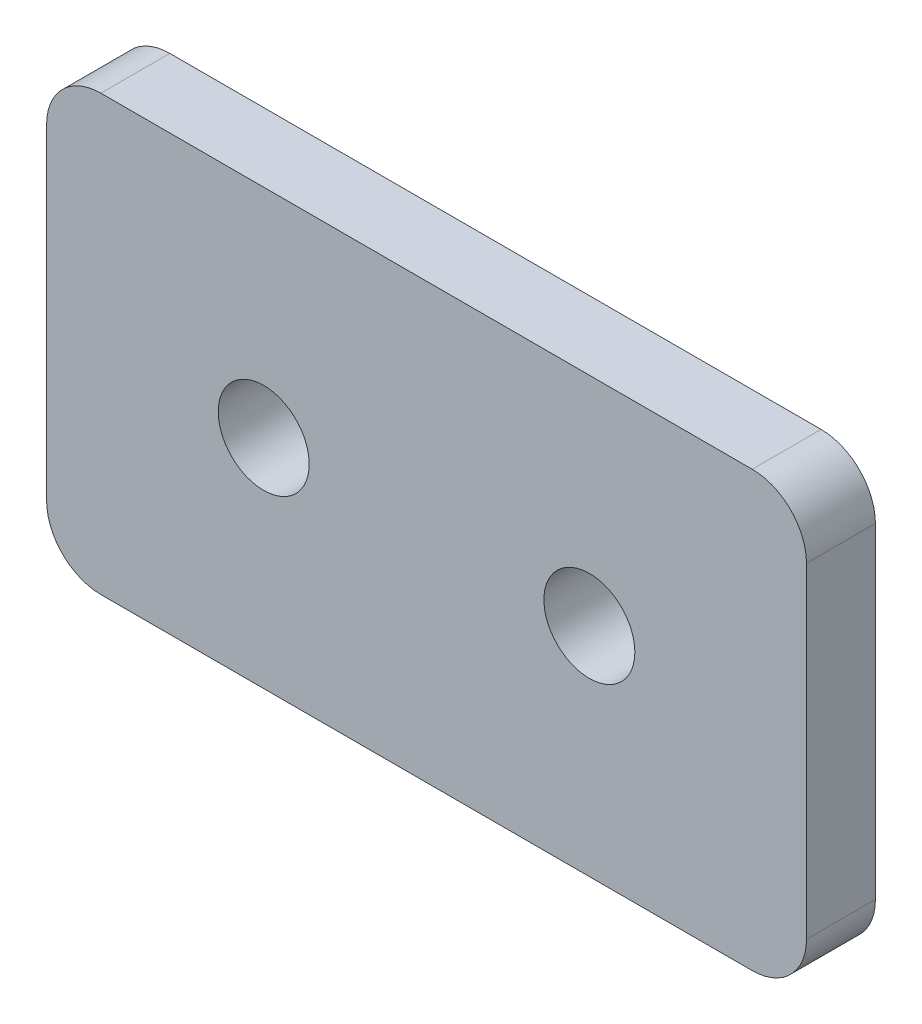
ISO-10303-21;
HEADER;
FILE_DESCRIPTION(('STEP AP214'),'2;1');
FILE_NAME('part.step','',(''),(''),'','','');
FILE_SCHEMA(('AUTOMOTIVE_DESIGN { 1 0 10303 214 1 1 1 1 }'));
ENDSEC;
DATA;
#1=APPLICATION_CONTEXT('core data for automotive mechanical design processes');
#2=APPLICATION_PROTOCOL_DEFINITION('international standard','automotive_design',2000,#1);
#3=PRODUCT_CONTEXT('',#1,'mechanical');
#4=PRODUCT('Part','Part','',(#3));
#5=PRODUCT_RELATED_PRODUCT_CATEGORY('part','',(#4));
#6=PRODUCT_DEFINITION_FORMATION('','',#4);
#7=PRODUCT_DEFINITION_CONTEXT('part definition',#1,'design');
#8=PRODUCT_DEFINITION('design','',#6,#7);
#9=PRODUCT_DEFINITION_SHAPE('','',#8);
#10=(LENGTH_UNIT() NAMED_UNIT(*) SI_UNIT(.MILLI.,.METRE.));
#11=(NAMED_UNIT(*) PLANE_ANGLE_UNIT() SI_UNIT($,.RADIAN.));
#12=(NAMED_UNIT(*) SI_UNIT($,.STERADIAN.) SOLID_ANGLE_UNIT());
#13=UNCERTAINTY_MEASURE_WITH_UNIT(LENGTH_MEASURE(1.E-05),#10,'distance_accuracy_value','');
#14=(GEOMETRIC_REPRESENTATION_CONTEXT(3) GLOBAL_UNCERTAINTY_ASSIGNED_CONTEXT((#13)) GLOBAL_UNIT_ASSIGNED_CONTEXT((#10,
#11,#12)) REPRESENTATION_CONTEXT('',''));
#15=CARTESIAN_POINT('',(0.,0.,0.));
#16=DIRECTION('',(0.,0.,1.));
#17=DIRECTION('',(1.,0.,0.));
#18=AXIS2_PLACEMENT_3D('',#15,#16,#17);
#19=CARTESIAN_POINT('',(25.0000000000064,0.,3.175));
#20=DIRECTION('',(1.,0.,0.));
#21=DIRECTION('',(0.,0.,-1.));
#22=AXIS2_PLACEMENT_3D('',#19,#20,#21);
#23=PLANE('',#22);
#24=DIRECTION('',(0.,-1.,0.));
#25=VECTOR('',#24,1.);
#26=CARTESIAN_POINT('',(25.0000000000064,0.,3.175));
#27=LINE('',#26,#25);
#28=CARTESIAN_POINT('',(25.0000000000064,7.50000000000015,3.175));
#29=VERTEX_POINT('',#28);
#30=CARTESIAN_POINT('',(25.0000000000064,-7.50000000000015,3.175));
#31=VERTEX_POINT('',#30);
#32=EDGE_CURVE('E165',#29,#31,#27,.T.);
#33=ORIENTED_EDGE('',*,*,#32,.T.);
#34=DIRECTION('',(0.,0.,-1.));
#35=VECTOR('',#34,1.);
#36=CARTESIAN_POINT('',(25.0000000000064,-7.50000000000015,0.));
#37=LINE('',#36,#35);
#38=CARTESIAN_POINT('',(25.0000000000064,-7.50000000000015,0.));
#39=VERTEX_POINT('',#38);
#40=EDGE_CURVE('E126',#31,#39,#37,.T.);
#41=ORIENTED_EDGE('',*,*,#40,.T.);
#42=DIRECTION('',(0.,-1.,0.));
#43=VECTOR('',#42,1.);
#44=CARTESIAN_POINT('',(25.0000000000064,0.,0.));
#45=LINE('',#44,#43);
#46=CARTESIAN_POINT('',(25.0000000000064,7.50000000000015,0.));
#47=VERTEX_POINT('',#46);
#48=EDGE_CURVE('E110',#47,#39,#45,.T.);
#49=ORIENTED_EDGE('',*,*,#48,.F.);
#50=DIRECTION('',(0.,0.,-1.));
#51=VECTOR('',#50,1.);
#52=CARTESIAN_POINT('',(25.0000000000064,7.50000000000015,3.175));
#53=LINE('',#52,#51);
#54=EDGE_CURVE('E123',#47,#29,#53,.F.);
#55=ORIENTED_EDGE('',*,*,#54,.T.);
#56=EDGE_LOOP('',(#33,#41,#49,#55));
#57=FACE_BOUND('',#56,.T.);
#58=ADVANCED_FACE('F41',(#57),#23,.T.);
#59=CARTESIAN_POINT('',(0.,10.0000000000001,3.175));
#60=DIRECTION('',(0.,1.,0.));
#61=DIRECTION('',(0.,0.,1.));
#62=AXIS2_PLACEMENT_3D('',#59,#60,#61);
#63=PLANE('',#62);
#64=DIRECTION('',(1.,0.,0.));
#65=VECTOR('',#64,1.);
#66=CARTESIAN_POINT('',(0.,10.0000000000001,3.175));
#67=LINE('',#66,#65);
#68=CARTESIAN_POINT('',(-7.4999999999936,10.0000000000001,3.175));
#69=VERTEX_POINT('',#68);
#70=CARTESIAN_POINT('',(22.5000000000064,10.0000000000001,3.175));
#71=VERTEX_POINT('',#70);
#72=EDGE_CURVE('E164',#69,#71,#67,.T.);
#73=ORIENTED_EDGE('',*,*,#72,.T.);
#74=DIRECTION('',(0.,0.,-1.));
#75=VECTOR('',#74,1.);
#76=CARTESIAN_POINT('',(22.5000000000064,10.0000000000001,3.175));
#77=LINE('',#76,#75);
#78=CARTESIAN_POINT('',(22.5000000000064,10.0000000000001,0.));
#79=VERTEX_POINT('',#78);
#80=EDGE_CURVE('E159',#71,#79,#77,.T.);
#81=ORIENTED_EDGE('',*,*,#80,.T.);
#82=DIRECTION('',(1.,0.,0.));
#83=VECTOR('',#82,1.);
#84=CARTESIAN_POINT('',(0.,10.0000000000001,0.));
#85=LINE('',#84,#83);
#86=CARTESIAN_POINT('',(-7.4999999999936,10.0000000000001,0.));
#87=VERTEX_POINT('',#86);
#88=EDGE_CURVE('E112',#87,#79,#85,.T.);
#89=ORIENTED_EDGE('',*,*,#88,.F.);
#90=DIRECTION('',(0.,0.,-1.));
#91=VECTOR('',#90,1.);
#92=CARTESIAN_POINT('',(-7.4999999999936,10.0000000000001,3.175));
#93=LINE('',#92,#91);
#94=EDGE_CURVE('E157',#87,#69,#93,.F.);
#95=ORIENTED_EDGE('',*,*,#94,.T.);
#96=EDGE_LOOP('',(#73,#81,#89,#95));
#97=FACE_BOUND('',#96,.T.);
#98=ADVANCED_FACE('F162',(#97),#63,.T.);
#99=CARTESIAN_POINT('',(-9.9999999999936,0.,3.175));
#100=DIRECTION('',(1.,0.,0.));
#101=DIRECTION('',(0.,0.,-1.));
#102=AXIS2_PLACEMENT_3D('',#99,#100,#101);
#103=PLANE('',#102);
#104=DIRECTION('',(0.,-1.,0.));
#105=VECTOR('',#104,1.);
#106=CARTESIAN_POINT('',(-9.9999999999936,0.,3.175));
#107=LINE('',#106,#105);
#108=CARTESIAN_POINT('',(-9.9999999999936,7.50000000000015,3.175));
#109=VERTEX_POINT('',#108);
#110=CARTESIAN_POINT('',(-9.9999999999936,-7.50000000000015,3.175));
#111=VERTEX_POINT('',#110);
#112=EDGE_CURVE('E137',#109,#111,#107,.T.);
#113=ORIENTED_EDGE('',*,*,#112,.F.);
#114=DIRECTION('',(0.,0.,-1.));
#115=VECTOR('',#114,1.);
#116=CARTESIAN_POINT('',(-9.9999999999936,7.50000000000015,0.));
#117=LINE('',#116,#115);
#118=CARTESIAN_POINT('',(-9.9999999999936,7.50000000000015,0.));
#119=VERTEX_POINT('',#118);
#120=EDGE_CURVE('E11',#109,#119,#117,.T.);
#121=ORIENTED_EDGE('',*,*,#120,.T.);
#122=DIRECTION('',(0.,-1.,0.));
#123=VECTOR('',#122,1.);
#124=CARTESIAN_POINT('',(-9.9999999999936,0.,0.));
#125=LINE('',#124,#123);
#126=CARTESIAN_POINT('',(-9.9999999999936,-7.50000000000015,0.));
#127=VERTEX_POINT('',#126);
#128=EDGE_CURVE('E177',#119,#127,#125,.T.);
#129=ORIENTED_EDGE('',*,*,#128,.T.);
#130=DIRECTION('',(0.,0.,-1.));
#131=VECTOR('',#130,1.);
#132=CARTESIAN_POINT('',(-9.9999999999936,-7.50000000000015,3.175));
#133=LINE('',#132,#131);
#134=EDGE_CURVE('E49',#127,#111,#133,.F.);
#135=ORIENTED_EDGE('',*,*,#134,.T.);
#136=EDGE_LOOP('',(#113,#121,#129,#135));
#137=FACE_BOUND('',#136,.T.);
#138=ADVANCED_FACE('F221',(#137),#103,.F.);
#139=CARTESIAN_POINT('',(6.37554245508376E-12,0.,3.175));
#140=DIRECTION('',(0.,0.,-1.));
#141=DIRECTION('',(-1.,0.,0.));
#142=AXIS2_PLACEMENT_3D('',#139,#140,#141);
#143=CYLINDRICAL_SURFACE('',#142,2.09499999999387);
#144=CARTESIAN_POINT('',(6.37554245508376E-12,0.,3.175));
#145=DIRECTION('',(0.,0.,1.));
#146=DIRECTION('',(1.,0.,0.));
#147=AXIS2_PLACEMENT_3D('',#144,#145,#146);
#148=CIRCLE('',#147,2.09499999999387);
#149=CARTESIAN_POINT('',(2.09500000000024,0.,3.175));
#150=VERTEX_POINT('',#149);
#151=EDGE_CURVE('E168',#150,#150,#148,.T.);
#152=ORIENTED_EDGE('',*,*,#151,.T.);
#153=EDGE_LOOP('',(#152));
#154=FACE_BOUND('',#153,.T.);
#155=CARTESIAN_POINT('',(6.37554245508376E-12,0.,0.));
#156=DIRECTION('',(0.,0.,1.));
#157=DIRECTION('',(1.,0.,0.));
#158=AXIS2_PLACEMENT_3D('',#155,#156,#157);
#159=CIRCLE('',#158,2.09499999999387);
#160=CARTESIAN_POINT('',(2.09500000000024,0.,0.));
#161=VERTEX_POINT('',#160);
#162=EDGE_CURVE('E127',#161,#161,#159,.T.);
#163=ORIENTED_EDGE('',*,*,#162,.F.);
#164=EDGE_LOOP('',(#163));
#165=FACE_BOUND('',#164,.T.);
#166=ADVANCED_FACE('F191',(#154,#165),#143,.F.);
#167=CARTESIAN_POINT('',(15.0000000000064,0.,3.175));
#168=DIRECTION('',(0.,0.,-1.));
#169=DIRECTION('',(-1.,0.,0.));
#170=AXIS2_PLACEMENT_3D('',#167,#168,#169);
#171=CYLINDRICAL_SURFACE('',#170,2.09499999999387);
#172=CARTESIAN_POINT('',(15.0000000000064,0.,3.175));
#173=DIRECTION('',(0.,0.,1.));
#174=DIRECTION('',(1.,0.,0.));
#175=AXIS2_PLACEMENT_3D('',#172,#173,#174);
#176=CIRCLE('',#175,2.09499999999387);
#177=CARTESIAN_POINT('',(17.0950000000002,0.,3.175));
#178=VERTEX_POINT('',#177);
#179=EDGE_CURVE('E180',#178,#178,#176,.T.);
#180=ORIENTED_EDGE('',*,*,#179,.T.);
#181=EDGE_LOOP('',(#180));
#182=FACE_BOUND('',#181,.T.);
#183=CARTESIAN_POINT('',(15.0000000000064,0.,0.));
#184=DIRECTION('',(0.,0.,1.));
#185=DIRECTION('',(1.,0.,0.));
#186=AXIS2_PLACEMENT_3D('',#183,#184,#185);
#187=CIRCLE('',#186,2.09499999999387);
#188=CARTESIAN_POINT('',(17.0950000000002,0.,0.));
#189=VERTEX_POINT('',#188);
#190=EDGE_CURVE('E172',#189,#189,#187,.T.);
#191=ORIENTED_EDGE('',*,*,#190,.F.);
#192=EDGE_LOOP('',(#191));
#193=FACE_BOUND('',#192,.T.);
#194=ADVANCED_FACE('F207',(#182,#193),#171,.F.);
#195=CARTESIAN_POINT('',(0.,-10.0000000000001,3.175));
#196=DIRECTION('',(0.,1.,0.));
#197=DIRECTION('',(0.,0.,1.));
#198=AXIS2_PLACEMENT_3D('',#195,#196,#197);
#199=PLANE('',#198);
#200=DIRECTION('',(1.,0.,0.));
#201=VECTOR('',#200,1.);
#202=CARTESIAN_POINT('',(0.,-10.0000000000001,0.));
#203=LINE('',#202,#201);
#204=CARTESIAN_POINT('',(-7.4999999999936,-10.0000000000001,0.));
#205=VERTEX_POINT('',#204);
#206=CARTESIAN_POINT('',(22.5000000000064,-10.0000000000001,0.));
#207=VERTEX_POINT('',#206);
#208=EDGE_CURVE('E140',#205,#207,#203,.T.);
#209=ORIENTED_EDGE('',*,*,#208,.T.);
#210=DIRECTION('',(0.,0.,-1.));
#211=VECTOR('',#210,1.);
#212=CARTESIAN_POINT('',(22.5000000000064,-10.0000000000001,3.175));
#213=LINE('',#212,#211);
#214=CARTESIAN_POINT('',(22.5000000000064,-10.0000000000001,3.175));
#215=VERTEX_POINT('',#214);
#216=EDGE_CURVE('E149',#207,#215,#213,.F.);
#217=ORIENTED_EDGE('',*,*,#216,.T.);
#218=DIRECTION('',(1.,0.,0.));
#219=VECTOR('',#218,1.);
#220=CARTESIAN_POINT('',(0.,-10.0000000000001,3.175));
#221=LINE('',#220,#219);
#222=CARTESIAN_POINT('',(-7.4999999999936,-10.0000000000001,3.175));
#223=VERTEX_POINT('',#222);
#224=EDGE_CURVE('E132',#223,#215,#221,.T.);
#225=ORIENTED_EDGE('',*,*,#224,.F.);
#226=DIRECTION('',(0.,0.,-1.));
#227=VECTOR('',#226,1.);
#228=CARTESIAN_POINT('',(-7.4999999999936,-10.0000000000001,3.175));
#229=LINE('',#228,#227);
#230=EDGE_CURVE('E146',#223,#205,#229,.T.);
#231=ORIENTED_EDGE('',*,*,#230,.T.);
#232=EDGE_LOOP('',(#209,#217,#225,#231));
#233=FACE_BOUND('',#232,.T.);
#234=ADVANCED_FACE('F196',(#233),#199,.F.);
#235=CARTESIAN_POINT('',(0.,0.,3.175));
#236=DIRECTION('',(0.,0.,1.));
#237=DIRECTION('',(1.,0.,0.));
#238=AXIS2_PLACEMENT_3D('',#235,#236,#237);
#239=PLANE('',#238);
#240=ORIENTED_EDGE('',*,*,#179,.F.);
#241=EDGE_LOOP('',(#240));
#242=FACE_BOUND('',#241,.T.);
#243=ORIENTED_EDGE('',*,*,#151,.F.);
#244=EDGE_LOOP('',(#243));
#245=FACE_BOUND('',#244,.T.);
#246=ORIENTED_EDGE('',*,*,#224,.T.);
#247=CARTESIAN_POINT('',(22.5000000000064,-7.50000000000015,3.175));
#248=DIRECTION('',(0.,0.,1.));
#249=DIRECTION('',(1.,0.,0.));
#250=AXIS2_PLACEMENT_3D('',#247,#248,#249);
#251=CIRCLE('',#250,2.5);
#252=EDGE_CURVE('E155',#215,#31,#251,.T.);
#253=ORIENTED_EDGE('',*,*,#252,.T.);
#254=ORIENTED_EDGE('',*,*,#32,.F.);
#255=CARTESIAN_POINT('',(22.5000000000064,7.50000000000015,3.175));
#256=DIRECTION('',(0.,0.,1.));
#257=DIRECTION('',(1.,0.,0.));
#258=AXIS2_PLACEMENT_3D('',#255,#256,#257);
#259=CIRCLE('',#258,2.5);
#260=EDGE_CURVE('E131',#29,#71,#259,.T.);
#261=ORIENTED_EDGE('',*,*,#260,.T.);
#262=ORIENTED_EDGE('',*,*,#72,.F.);
#263=CARTESIAN_POINT('',(-7.4999999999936,7.50000000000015,3.175));
#264=DIRECTION('',(0.,0.,1.));
#265=DIRECTION('',(1.,0.,0.));
#266=AXIS2_PLACEMENT_3D('',#263,#264,#265);
#267=CIRCLE('',#266,2.5);
#268=EDGE_CURVE('E62',#69,#109,#267,.T.);
#269=ORIENTED_EDGE('',*,*,#268,.T.);
#270=ORIENTED_EDGE('',*,*,#112,.T.);
#271=CARTESIAN_POINT('',(-7.4999999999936,-7.50000000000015,3.175));
#272=DIRECTION('',(0.,0.,1.));
#273=DIRECTION('',(1.,0.,0.));
#274=AXIS2_PLACEMENT_3D('',#271,#272,#273);
#275=CIRCLE('',#274,2.5);
#276=EDGE_CURVE('E151',#111,#223,#275,.T.);
#277=ORIENTED_EDGE('',*,*,#276,.T.);
#278=EDGE_LOOP('',(#246,#253,#254,#261,#262,#269,#270,#277));
#279=FACE_BOUND('',#278,.T.);
#280=ADVANCED_FACE('F194',(#242,#245,#279),#239,.T.);
#281=CARTESIAN_POINT('',(0.,0.,0.));
#282=DIRECTION('',(0.,0.,1.));
#283=DIRECTION('',(1.,0.,0.));
#284=AXIS2_PLACEMENT_3D('',#281,#282,#283);
#285=PLANE('',#284);
#286=ORIENTED_EDGE('',*,*,#190,.T.);
#287=EDGE_LOOP('',(#286));
#288=FACE_BOUND('',#287,.T.);
#289=ORIENTED_EDGE('',*,*,#162,.T.);
#290=EDGE_LOOP('',(#289));
#291=FACE_BOUND('',#290,.T.);
#292=ORIENTED_EDGE('',*,*,#48,.T.);
#293=CARTESIAN_POINT('',(22.5000000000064,-7.50000000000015,0.));
#294=DIRECTION('',(0.,0.,1.));
#295=DIRECTION('',(1.,0.,0.));
#296=AXIS2_PLACEMENT_3D('',#293,#294,#295);
#297=CIRCLE('',#296,2.5);
#298=EDGE_CURVE('E117',#39,#207,#297,.F.);
#299=ORIENTED_EDGE('',*,*,#298,.T.);
#300=ORIENTED_EDGE('',*,*,#208,.F.);
#301=CARTESIAN_POINT('',(-7.4999999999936,-7.50000000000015,0.));
#302=DIRECTION('',(0.,0.,1.));
#303=DIRECTION('',(1.,0.,0.));
#304=AXIS2_PLACEMENT_3D('',#301,#302,#303);
#305=CIRCLE('',#304,2.5);
#306=EDGE_CURVE('E134',#205,#127,#305,.F.);
#307=ORIENTED_EDGE('',*,*,#306,.T.);
#308=ORIENTED_EDGE('',*,*,#128,.F.);
#309=CARTESIAN_POINT('',(-7.4999999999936,7.50000000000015,0.));
#310=DIRECTION('',(0.,0.,1.));
#311=DIRECTION('',(1.,0.,0.));
#312=AXIS2_PLACEMENT_3D('',#309,#310,#311);
#313=CIRCLE('',#312,2.5);
#314=EDGE_CURVE('E118',#119,#87,#313,.F.);
#315=ORIENTED_EDGE('',*,*,#314,.T.);
#316=ORIENTED_EDGE('',*,*,#88,.T.);
#317=CARTESIAN_POINT('',(22.5000000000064,7.50000000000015,0.));
#318=DIRECTION('',(0.,0.,1.));
#319=DIRECTION('',(1.,0.,0.));
#320=AXIS2_PLACEMENT_3D('',#317,#318,#319);
#321=CIRCLE('',#320,2.5);
#322=EDGE_CURVE('E107',#79,#47,#321,.F.);
#323=ORIENTED_EDGE('',*,*,#322,.T.);
#324=EDGE_LOOP('',(#292,#299,#300,#307,#308,#315,#316,#323));
#325=FACE_BOUND('',#324,.T.);
#326=ADVANCED_FACE('F109',(#288,#291,#325),#285,.F.);
#327=CARTESIAN_POINT('',(22.5000000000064,-7.50000000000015,3.175));
#328=DIRECTION('',(0.,0.,1.));
#329=DIRECTION('',(1.,0.,0.));
#330=AXIS2_PLACEMENT_3D('',#327,#328,#329);
#331=CYLINDRICAL_SURFACE('',#330,2.5);
#332=ORIENTED_EDGE('',*,*,#252,.F.);
#333=ORIENTED_EDGE('',*,*,#216,.F.);
#334=ORIENTED_EDGE('',*,*,#298,.F.);
#335=ORIENTED_EDGE('',*,*,#40,.F.);
#336=EDGE_LOOP('',(#332,#333,#334,#335));
#337=FACE_BOUND('',#336,.T.);
#338=ADVANCED_FACE('F204',(#337),#331,.T.);
#339=CARTESIAN_POINT('',(22.5000000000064,7.50000000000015,3.175));
#340=DIRECTION('',(0.,0.,-1.));
#341=DIRECTION('',(-1.,0.,0.));
#342=AXIS2_PLACEMENT_3D('',#339,#340,#341);
#343=CYLINDRICAL_SURFACE('',#342,2.5);
#344=ORIENTED_EDGE('',*,*,#260,.F.);
#345=ORIENTED_EDGE('',*,*,#54,.F.);
#346=ORIENTED_EDGE('',*,*,#322,.F.);
#347=ORIENTED_EDGE('',*,*,#80,.F.);
#348=EDGE_LOOP('',(#344,#345,#346,#347));
#349=FACE_BOUND('',#348,.T.);
#350=ADVANCED_FACE('F130',(#349),#343,.T.);
#351=CARTESIAN_POINT('',(-7.4999999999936,7.50000000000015,3.175));
#352=DIRECTION('',(0.,0.,1.));
#353=DIRECTION('',(1.,0.,0.));
#354=AXIS2_PLACEMENT_3D('',#351,#352,#353);
#355=CYLINDRICAL_SURFACE('',#354,2.5);
#356=ORIENTED_EDGE('',*,*,#268,.F.);
#357=ORIENTED_EDGE('',*,*,#94,.F.);
#358=ORIENTED_EDGE('',*,*,#314,.F.);
#359=ORIENTED_EDGE('',*,*,#120,.F.);
#360=EDGE_LOOP('',(#356,#357,#358,#359));
#361=FACE_BOUND('',#360,.T.);
#362=ADVANCED_FACE('F229',(#361),#355,.T.);
#363=CARTESIAN_POINT('',(-7.4999999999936,-7.50000000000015,3.175));
#364=DIRECTION('',(0.,0.,-1.));
#365=DIRECTION('',(-1.,0.,0.));
#366=AXIS2_PLACEMENT_3D('',#363,#364,#365);
#367=CYLINDRICAL_SURFACE('',#366,2.5);
#368=ORIENTED_EDGE('',*,*,#276,.F.);
#369=ORIENTED_EDGE('',*,*,#134,.F.);
#370=ORIENTED_EDGE('',*,*,#306,.F.);
#371=ORIENTED_EDGE('',*,*,#230,.F.);
#372=EDGE_LOOP('',(#368,#369,#370,#371));
#373=FACE_BOUND('',#372,.T.);
#374=ADVANCED_FACE('F43',(#373),#367,.T.);
#375=CLOSED_SHELL('',(#58,#98,#138,#166,#194,#234,#280,#326,#338,#350,#362,#374));
#376=MANIFOLD_SOLID_BREP('B2',#375);
#377=ADVANCED_BREP_SHAPE_REPRESENTATION('',(#18,#376),#14);
#378=SHAPE_DEFINITION_REPRESENTATION(#9,#377);
ENDSEC;
END-ISO-10303-21;
